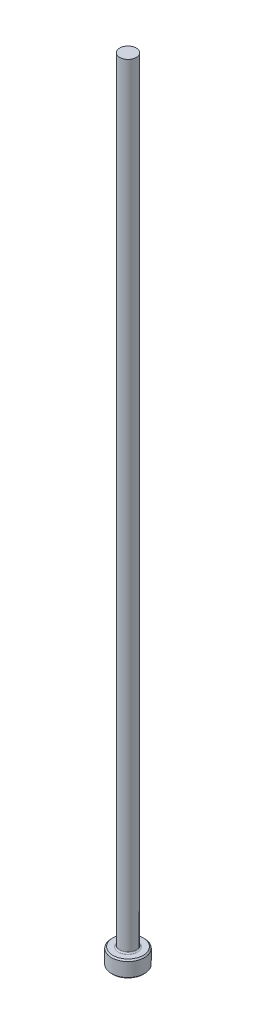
from build123d import *

# Parameters (mm, degrees)
CHAMFER1_SIZE = 0.254
FILLET1_R     = 0.254


with BuildPart() as part:
    # Sketch1 → Revolve1 (revolve)
    with BuildSketch(Plane.XY, mode=Mode.PRIVATE) as revolve1_sk:
        Polygon((0, 0), (-3.175, 0), (-3.175, 3.175), (-1.5875, 3.175), (-1.5875, 152.4), (0, 152.4), align=None)
    revolve(revolve1_sk.sketch.rotate(Axis((0, 259.958771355, 0), (0, -1, 0)), 270), axis=Axis((0, 259.958771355, 0), (0, -1, 0)))

    # Chamfer1
    chamfer1_edges = [part.edges().sort_by_distance(p)[0] for p in [
        (0, 3.175, -3.175),
        (0, 0, -3.175),
    ]]
    chamfer(chamfer1_edges, length=CHAMFER1_SIZE)

    # Fillet1
    fillet1_edges = [part.edges().sort_by_distance(p)[0] for p in [
        (0, 3.175, -1.5875),
    ]]
    fillet(fillet1_edges, radius=FILLET1_R)


solid = part.part
